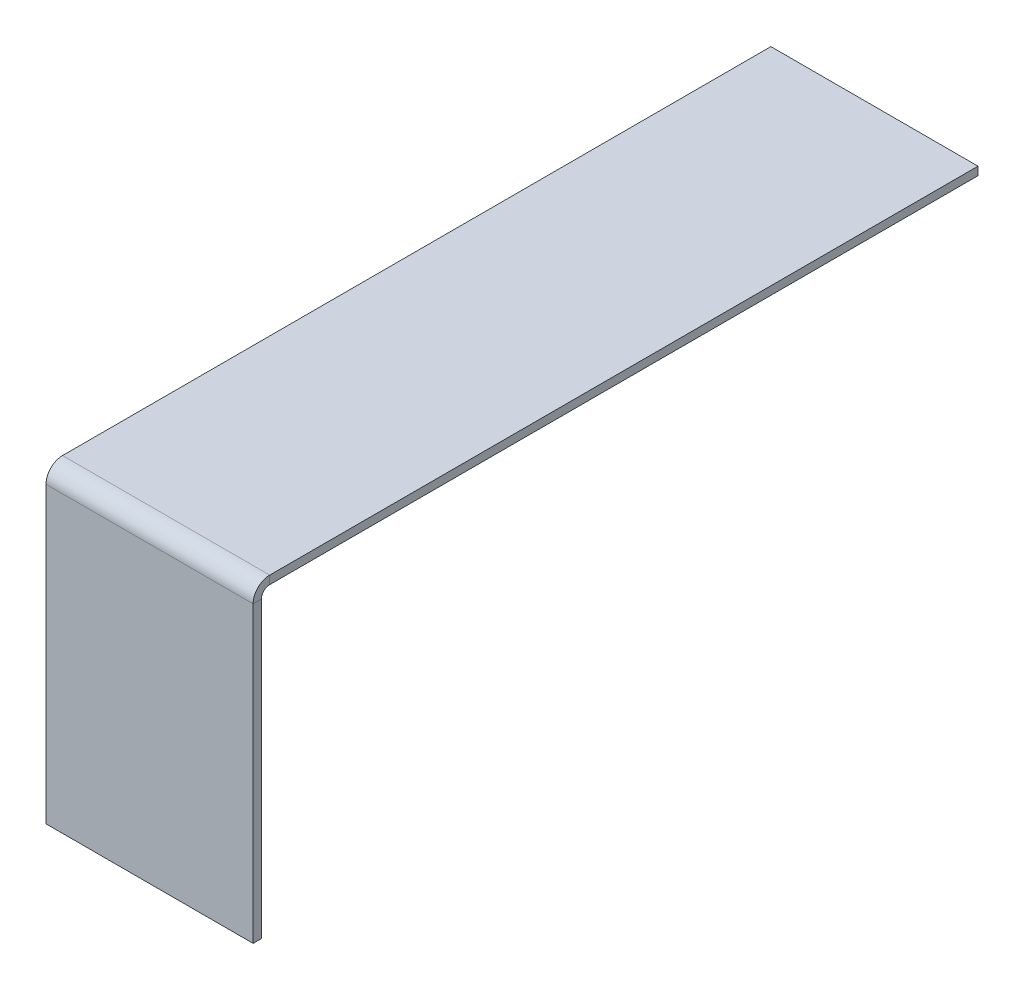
ISO-10303-21;
HEADER;
FILE_DESCRIPTION(('STEP AP214'),'2;1');
FILE_NAME('part.step','',(''),(''),'','','');
FILE_SCHEMA(('AUTOMOTIVE_DESIGN { 1 0 10303 214 1 1 1 1 }'));
ENDSEC;
DATA;
#1=APPLICATION_CONTEXT('core data for automotive mechanical design processes');
#2=APPLICATION_PROTOCOL_DEFINITION('international standard','automotive_design',2000,#1);
#3=PRODUCT_CONTEXT('',#1,'mechanical');
#4=PRODUCT('Part','Part','',(#3));
#5=PRODUCT_RELATED_PRODUCT_CATEGORY('part','',(#4));
#6=PRODUCT_DEFINITION_FORMATION('','',#4);
#7=PRODUCT_DEFINITION_CONTEXT('part definition',#1,'design');
#8=PRODUCT_DEFINITION('design','',#6,#7);
#9=PRODUCT_DEFINITION_SHAPE('','',#8);
#10=(LENGTH_UNIT() NAMED_UNIT(*) SI_UNIT(.MILLI.,.METRE.));
#11=(NAMED_UNIT(*) PLANE_ANGLE_UNIT() SI_UNIT($,.RADIAN.));
#12=(NAMED_UNIT(*) SI_UNIT($,.STERADIAN.) SOLID_ANGLE_UNIT());
#13=UNCERTAINTY_MEASURE_WITH_UNIT(LENGTH_MEASURE(1.E-05),#10,'distance_accuracy_value','');
#14=(GEOMETRIC_REPRESENTATION_CONTEXT(3) GLOBAL_UNCERTAINTY_ASSIGNED_CONTEXT((#13)) GLOBAL_UNIT_ASSIGNED_CONTEXT((#10,
#11,#12)) REPRESENTATION_CONTEXT('',''));
#15=CARTESIAN_POINT('',(0.,0.,0.));
#16=DIRECTION('',(0.,0.,1.));
#17=DIRECTION('',(1.,0.,0.));
#18=AXIS2_PLACEMENT_3D('',#15,#16,#17);
#19=CARTESIAN_POINT('',(-25.,-256.320080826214,-175.));
#20=DIRECTION('',(0.,0.,1.));
#21=DIRECTION('',(0.,-1.,0.));
#22=AXIS2_PLACEMENT_3D('',#19,#20,#21);
#23=PLANE('',#22);
#24=DIRECTION('',(0.,1.,0.));
#25=VECTOR('',#24,1.);
#26=CARTESIAN_POINT('',(-25.,-256.320080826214,-175.));
#27=LINE('',#26,#25);
#28=CARTESIAN_POINT('',(-25.,98.,-175.));
#29=VERTEX_POINT('',#28);
#30=CARTESIAN_POINT('',(-25.,100.,-175.));
#31=VERTEX_POINT('',#30);
#32=EDGE_CURVE('E72',#29,#31,#27,.T.);
#33=ORIENTED_EDGE('',*,*,#32,.T.);
#34=DIRECTION('',(1.,0.,0.));
#35=VECTOR('',#34,1.);
#36=CARTESIAN_POINT('',(-25.,100.,-175.));
#37=LINE('',#36,#35);
#38=CARTESIAN_POINT('',(25.,100.,-175.));
#39=VERTEX_POINT('',#38);
#40=EDGE_CURVE('E137',#31,#39,#37,.T.);
#41=ORIENTED_EDGE('',*,*,#40,.T.);
#42=DIRECTION('',(0.,1.,0.));
#43=VECTOR('',#42,1.);
#44=CARTESIAN_POINT('',(25.,-256.320080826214,-175.));
#45=LINE('',#44,#43);
#46=CARTESIAN_POINT('',(25.,98.,-175.));
#47=VERTEX_POINT('',#46);
#48=EDGE_CURVE('E159',#47,#39,#45,.T.);
#49=ORIENTED_EDGE('',*,*,#48,.F.);
#50=DIRECTION('',(1.,0.,0.));
#51=VECTOR('',#50,1.);
#52=CARTESIAN_POINT('',(-25.,98.,-175.));
#53=LINE('',#52,#51);
#54=EDGE_CURVE('E41',#29,#47,#53,.T.);
#55=ORIENTED_EDGE('',*,*,#54,.F.);
#56=EDGE_LOOP('',(#33,#41,#49,#55));
#57=FACE_BOUND('',#56,.T.);
#58=ADVANCED_FACE('F31',(#57),#23,.F.);
#59=CARTESIAN_POINT('',(-25.,-256.320080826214,-4.));
#60=DIRECTION('',(1.,0.,0.));
#61=DIRECTION('',(0.,-1.,0.));
#62=AXIS2_PLACEMENT_3D('',#59,#60,#61);
#63=PLANE('',#62);
#64=DIRECTION('',(0.,1.,0.));
#65=VECTOR('',#64,1.);
#66=CARTESIAN_POINT('',(-25.,-256.320080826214,-4.));
#67=LINE('',#66,#65);
#68=CARTESIAN_POINT('',(-25.,98.,-4.));
#69=VERTEX_POINT('',#68);
#70=CARTESIAN_POINT('',(-25.,100.,-4.00000000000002));
#71=VERTEX_POINT('',#70);
#72=EDGE_CURVE('E131',#69,#71,#67,.T.);
#73=ORIENTED_EDGE('',*,*,#72,.T.);
#74=DIRECTION('',(0.,0.,-1.));
#75=VECTOR('',#74,1.);
#76=CARTESIAN_POINT('',(-25.,100.,-3.99999999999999));
#77=LINE('',#76,#75);
#78=EDGE_CURVE('E126',#71,#31,#77,.T.);
#79=ORIENTED_EDGE('',*,*,#78,.T.);
#80=ORIENTED_EDGE('',*,*,#32,.F.);
#81=DIRECTION('',(0.,0.,-1.));
#82=VECTOR('',#81,1.);
#83=CARTESIAN_POINT('',(-25.,98.,-3.99999999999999));
#84=LINE('',#83,#82);
#85=EDGE_CURVE('E11',#69,#29,#84,.T.);
#86=ORIENTED_EDGE('',*,*,#85,.F.);
#87=EDGE_LOOP('',(#73,#79,#80,#86));
#88=FACE_BOUND('',#87,.T.);
#89=ADVANCED_FACE('F139',(#88),#63,.F.);
#90=CARTESIAN_POINT('',(-25.,100.,-3.99999999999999));
#91=DIRECTION('',(0.,-1.,0.));
#92=DIRECTION('',(0.,0.,-1.));
#93=AXIS2_PLACEMENT_3D('',#90,#91,#92);
#94=PLANE('',#93);
#95=DIRECTION('',(1.,0.,0.));
#96=VECTOR('',#95,1.);
#97=CARTESIAN_POINT('',(-25.,100.,-3.99999999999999));
#98=LINE('',#97,#96);
#99=CARTESIAN_POINT('',(25.,100.,-3.99999999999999));
#100=VERTEX_POINT('',#99);
#101=EDGE_CURVE('E117',#71,#100,#98,.T.);
#102=ORIENTED_EDGE('',*,*,#101,.T.);
#103=DIRECTION('',(0.,0.,-1.));
#104=VECTOR('',#103,1.);
#105=CARTESIAN_POINT('',(25.,100.,-3.99999999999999));
#106=LINE('',#105,#104);
#107=EDGE_CURVE('E65',#100,#39,#106,.T.);
#108=ORIENTED_EDGE('',*,*,#107,.T.);
#109=ORIENTED_EDGE('',*,*,#40,.F.);
#110=ORIENTED_EDGE('',*,*,#78,.F.);
#111=EDGE_LOOP('',(#102,#108,#109,#110));
#112=FACE_BOUND('',#111,.T.);
#113=ADVANCED_FACE('F136',(#112),#94,.F.);
#114=CARTESIAN_POINT('',(25.,-256.320080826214,-4.));
#115=DIRECTION('',(1.,0.,0.));
#116=DIRECTION('',(0.,-1.,0.));
#117=AXIS2_PLACEMENT_3D('',#114,#115,#116);
#118=PLANE('',#117);
#119=ORIENTED_EDGE('',*,*,#107,.F.);
#120=DIRECTION('',(0.,1.,0.));
#121=VECTOR('',#120,1.);
#122=CARTESIAN_POINT('',(25.,-256.320080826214,-4.));
#123=LINE('',#122,#121);
#124=CARTESIAN_POINT('',(25.,98.,-4.));
#125=VERTEX_POINT('',#124);
#126=EDGE_CURVE('E144',#125,#100,#123,.T.);
#127=ORIENTED_EDGE('',*,*,#126,.F.);
#128=DIRECTION('',(0.,0.,-1.));
#129=VECTOR('',#128,1.);
#130=CARTESIAN_POINT('',(25.,98.,-3.99999999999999));
#131=LINE('',#130,#129);
#132=EDGE_CURVE('E50',#125,#47,#131,.T.);
#133=ORIENTED_EDGE('',*,*,#132,.T.);
#134=ORIENTED_EDGE('',*,*,#48,.T.);
#135=EDGE_LOOP('',(#119,#127,#133,#134));
#136=FACE_BOUND('',#135,.T.);
#137=ADVANCED_FACE('F162',(#136),#118,.T.);
#138=CARTESIAN_POINT('',(-25.,98.,-3.99999999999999));
#139=DIRECTION('',(0.,-1.,0.));
#140=DIRECTION('',(0.,0.,-1.));
#141=AXIS2_PLACEMENT_3D('',#138,#139,#140);
#142=PLANE('',#141);
#143=ORIENTED_EDGE('',*,*,#54,.T.);
#144=ORIENTED_EDGE('',*,*,#132,.F.);
#145=DIRECTION('',(1.,0.,0.));
#146=VECTOR('',#145,1.);
#147=CARTESIAN_POINT('',(-25.,98.,-3.99999999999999));
#148=LINE('',#147,#146);
#149=EDGE_CURVE('E35',#69,#125,#148,.T.);
#150=ORIENTED_EDGE('',*,*,#149,.F.);
#151=ORIENTED_EDGE('',*,*,#85,.T.);
#152=EDGE_LOOP('',(#143,#144,#150,#151));
#153=FACE_BOUND('',#152,.T.);
#154=ADVANCED_FACE('F33',(#153),#142,.T.);
#155=CARTESIAN_POINT('',(-25.,25.,0.));
#156=DIRECTION('',(0.,0.,-1.));
#157=DIRECTION('',(0.,1.,0.));
#158=AXIS2_PLACEMENT_3D('',#155,#156,#157);
#159=PLANE('',#158);
#160=DIRECTION('',(1.,0.,0.));
#161=VECTOR('',#160,1.);
#162=CARTESIAN_POINT('',(-25.,25.,0.));
#163=LINE('',#162,#161);
#164=CARTESIAN_POINT('',(-25.,25.,0.));
#165=VERTEX_POINT('',#164);
#166=CARTESIAN_POINT('',(25.,25.,0.));
#167=VERTEX_POINT('',#166);
#168=EDGE_CURVE('E282',#165,#167,#163,.T.);
#169=ORIENTED_EDGE('',*,*,#168,.T.);
#170=DIRECTION('',(0.,1.,0.));
#171=VECTOR('',#170,1.);
#172=CARTESIAN_POINT('',(25.,25.,0.));
#173=LINE('',#172,#171);
#174=CARTESIAN_POINT('',(25.,96.,0.));
#175=VERTEX_POINT('',#174);
#176=EDGE_CURVE('E284',#167,#175,#173,.T.);
#177=ORIENTED_EDGE('',*,*,#176,.T.);
#178=DIRECTION('',(1.,0.,0.));
#179=VECTOR('',#178,1.);
#180=CARTESIAN_POINT('',(-25.,96.,0.));
#181=LINE('',#180,#179);
#182=CARTESIAN_POINT('',(-25.,96.,0.));
#183=VERTEX_POINT('',#182);
#184=EDGE_CURVE('E287',#183,#175,#181,.T.);
#185=ORIENTED_EDGE('',*,*,#184,.F.);
#186=DIRECTION('',(0.,1.,0.));
#187=VECTOR('',#186,1.);
#188=CARTESIAN_POINT('',(-25.,25.,0.));
#189=LINE('',#188,#187);
#190=EDGE_CURVE('E289',#165,#183,#189,.T.);
#191=ORIENTED_EDGE('',*,*,#190,.F.);
#192=EDGE_LOOP('',(#169,#177,#185,#191));
#193=FACE_BOUND('',#192,.T.);
#194=ADVANCED_FACE('F166',(#193),#159,.F.);
#195=CARTESIAN_POINT('',(25.,25.,-173.677862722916));
#196=DIRECTION('',(1.,0.,0.));
#197=DIRECTION('',(0.,0.,-1.));
#198=AXIS2_PLACEMENT_3D('',#195,#196,#197);
#199=PLANE('',#198);
#200=ORIENTED_EDGE('',*,*,#176,.F.);
#201=DIRECTION('',(0.,0.,1.));
#202=VECTOR('',#201,1.);
#203=CARTESIAN_POINT('',(25.,25.,-173.677862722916));
#204=LINE('',#203,#202);
#205=CARTESIAN_POINT('',(25.,25.,-2.));
#206=VERTEX_POINT('',#205);
#207=EDGE_CURVE('E148',#206,#167,#204,.T.);
#208=ORIENTED_EDGE('',*,*,#207,.F.);
#209=DIRECTION('',(0.,1.,0.));
#210=VECTOR('',#209,1.);
#211=CARTESIAN_POINT('',(25.,25.,-2.));
#212=LINE('',#211,#210);
#213=CARTESIAN_POINT('',(25.,96.,-2.));
#214=VERTEX_POINT('',#213);
#215=EDGE_CURVE('E293',#206,#214,#212,.T.);
#216=ORIENTED_EDGE('',*,*,#215,.T.);
#217=DIRECTION('',(0.,0.,1.));
#218=VECTOR('',#217,1.);
#219=CARTESIAN_POINT('',(25.,96.,-173.677862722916));
#220=LINE('',#219,#218);
#221=EDGE_CURVE('E146',#214,#175,#220,.T.);
#222=ORIENTED_EDGE('',*,*,#221,.T.);
#223=EDGE_LOOP('',(#200,#208,#216,#222));
#224=FACE_BOUND('',#223,.T.);
#225=ADVANCED_FACE('F171',(#224),#199,.T.);
#226=CARTESIAN_POINT('',(-25.,25.,-173.677862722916));
#227=DIRECTION('',(0.,-1.,0.));
#228=DIRECTION('',(0.,0.,-1.));
#229=AXIS2_PLACEMENT_3D('',#226,#227,#228);
#230=PLANE('',#229);
#231=ORIENTED_EDGE('',*,*,#168,.F.);
#232=DIRECTION('',(0.,0.,1.));
#233=VECTOR('',#232,1.);
#234=CARTESIAN_POINT('',(-25.,25.,-173.677862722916));
#235=LINE('',#234,#233);
#236=CARTESIAN_POINT('',(-25.,25.,-2.));
#237=VERTEX_POINT('',#236);
#238=EDGE_CURVE('E153',#237,#165,#235,.T.);
#239=ORIENTED_EDGE('',*,*,#238,.F.);
#240=DIRECTION('',(1.,0.,0.));
#241=VECTOR('',#240,1.);
#242=CARTESIAN_POINT('',(-25.,25.,-2.));
#243=LINE('',#242,#241);
#244=EDGE_CURVE('E88',#237,#206,#243,.T.);
#245=ORIENTED_EDGE('',*,*,#244,.T.);
#246=ORIENTED_EDGE('',*,*,#207,.T.);
#247=EDGE_LOOP('',(#231,#239,#245,#246));
#248=FACE_BOUND('',#247,.T.);
#249=ADVANCED_FACE('F211',(#248),#230,.T.);
#250=CARTESIAN_POINT('',(-25.,25.,-173.677862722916));
#251=DIRECTION('',(1.,0.,0.));
#252=DIRECTION('',(0.,0.,-1.));
#253=AXIS2_PLACEMENT_3D('',#250,#251,#252);
#254=PLANE('',#253);
#255=ORIENTED_EDGE('',*,*,#238,.T.);
#256=ORIENTED_EDGE('',*,*,#190,.T.);
#257=DIRECTION('',(0.,0.,1.));
#258=VECTOR('',#257,1.);
#259=CARTESIAN_POINT('',(-25.,96.,-173.677862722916));
#260=LINE('',#259,#258);
#261=CARTESIAN_POINT('',(-25.,96.,-1.99999999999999));
#262=VERTEX_POINT('',#261);
#263=EDGE_CURVE('E134',#262,#183,#260,.T.);
#264=ORIENTED_EDGE('',*,*,#263,.F.);
#265=DIRECTION('',(0.,1.,0.));
#266=VECTOR('',#265,1.);
#267=CARTESIAN_POINT('',(-25.,25.,-2.));
#268=LINE('',#267,#266);
#269=EDGE_CURVE('E296',#237,#262,#268,.T.);
#270=ORIENTED_EDGE('',*,*,#269,.F.);
#271=EDGE_LOOP('',(#255,#256,#264,#270));
#272=FACE_BOUND('',#271,.T.);
#273=ADVANCED_FACE('F219',(#272),#254,.F.);
#274=CARTESIAN_POINT('',(-25.,25.,-2.));
#275=DIRECTION('',(0.,0.,-1.));
#276=DIRECTION('',(0.,1.,0.));
#277=AXIS2_PLACEMENT_3D('',#274,#275,#276);
#278=PLANE('',#277);
#279=DIRECTION('',(1.,0.,0.));
#280=VECTOR('',#279,1.);
#281=CARTESIAN_POINT('',(-25.,96.,-1.99999999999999));
#282=LINE('',#281,#280);
#283=EDGE_CURVE('E277',#262,#214,#282,.T.);
#284=ORIENTED_EDGE('',*,*,#283,.T.);
#285=ORIENTED_EDGE('',*,*,#215,.F.);
#286=ORIENTED_EDGE('',*,*,#244,.F.);
#287=ORIENTED_EDGE('',*,*,#269,.T.);
#288=EDGE_LOOP('',(#284,#285,#286,#287));
#289=FACE_BOUND('',#288,.T.);
#290=ADVANCED_FACE('F227',(#289),#278,.T.);
#291=CARTESIAN_POINT('',(25.,96.,-3.99999999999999));
#292=DIRECTION('',(1.,0.,0.));
#293=DIRECTION('',(0.,0.,-1.));
#294=AXIS2_PLACEMENT_3D('',#291,#292,#293);
#295=PLANE('',#294);
#296=ORIENTED_EDGE('',*,*,#221,.F.);
#297=CARTESIAN_POINT('',(25.,96.,-3.99999999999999));
#298=DIRECTION('',(1.,0.,0.));
#299=DIRECTION('',(0.,0.,-1.));
#300=AXIS2_PLACEMENT_3D('',#297,#298,#299);
#301=CIRCLE('',#300,2.);
#302=EDGE_CURVE('E80',#214,#125,#301,.F.);
#303=ORIENTED_EDGE('',*,*,#302,.T.);
#304=ORIENTED_EDGE('',*,*,#126,.T.);
#305=CARTESIAN_POINT('',(25.,96.,-3.99999999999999));
#306=DIRECTION('',(1.,0.,0.));
#307=DIRECTION('',(0.,0.,-1.));
#308=AXIS2_PLACEMENT_3D('',#305,#306,#307);
#309=CIRCLE('',#308,4.);
#310=EDGE_CURVE('E123',#175,#100,#309,.F.);
#311=ORIENTED_EDGE('',*,*,#310,.F.);
#312=EDGE_LOOP('',(#296,#303,#304,#311));
#313=FACE_BOUND('',#312,.T.);
#314=ADVANCED_FACE('F237',(#313),#295,.T.);
#315=CARTESIAN_POINT('',(-25.,96.,-3.99999999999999));
#316=DIRECTION('',(-1.,0.,0.));
#317=DIRECTION('',(0.,0.,1.));
#318=AXIS2_PLACEMENT_3D('',#315,#316,#317);
#319=PLANE('',#318);
#320=ORIENTED_EDGE('',*,*,#72,.F.);
#321=CARTESIAN_POINT('',(-25.,96.,-3.99999999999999));
#322=DIRECTION('',(1.,0.,0.));
#323=DIRECTION('',(0.,0.,-1.));
#324=AXIS2_PLACEMENT_3D('',#321,#322,#323);
#325=CIRCLE('',#324,2.);
#326=EDGE_CURVE('E275',#69,#262,#325,.T.);
#327=ORIENTED_EDGE('',*,*,#326,.T.);
#328=ORIENTED_EDGE('',*,*,#263,.T.);
#329=CARTESIAN_POINT('',(-25.,96.,-3.99999999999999));
#330=DIRECTION('',(1.,0.,0.));
#331=DIRECTION('',(0.,0.,-1.));
#332=AXIS2_PLACEMENT_3D('',#329,#330,#331);
#333=CIRCLE('',#332,4.);
#334=EDGE_CURVE('E121',#71,#183,#333,.T.);
#335=ORIENTED_EDGE('',*,*,#334,.F.);
#336=EDGE_LOOP('',(#320,#327,#328,#335));
#337=FACE_BOUND('',#336,.T.);
#338=ADVANCED_FACE('F129',(#337),#319,.T.);
#339=CARTESIAN_POINT('',(-276.582035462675,96.,-3.99999999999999));
#340=DIRECTION('',(1.,0.,0.));
#341=DIRECTION('',(0.,0.,-1.));
#342=AXIS2_PLACEMENT_3D('',#339,#340,#341);
#343=CYLINDRICAL_SURFACE('',#342,4.);
#344=ORIENTED_EDGE('',*,*,#334,.T.);
#345=ORIENTED_EDGE('',*,*,#184,.T.);
#346=ORIENTED_EDGE('',*,*,#310,.T.);
#347=ORIENTED_EDGE('',*,*,#101,.F.);
#348=EDGE_LOOP('',(#344,#345,#346,#347));
#349=FACE_BOUND('',#348,.T.);
#350=ADVANCED_FACE('F119',(#349),#343,.T.);
#351=CARTESIAN_POINT('',(-276.582035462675,96.,-3.99999999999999));
#352=DIRECTION('',(1.,0.,0.));
#353=DIRECTION('',(0.,0.,-1.));
#354=AXIS2_PLACEMENT_3D('',#351,#352,#353);
#355=CYLINDRICAL_SURFACE('',#354,2.);
#356=ORIENTED_EDGE('',*,*,#326,.F.);
#357=ORIENTED_EDGE('',*,*,#149,.T.);
#358=ORIENTED_EDGE('',*,*,#302,.F.);
#359=ORIENTED_EDGE('',*,*,#283,.F.);
#360=EDGE_LOOP('',(#356,#357,#358,#359));
#361=FACE_BOUND('',#360,.T.);
#362=ADVANCED_FACE('F263',(#361),#355,.F.);
#363=CLOSED_SHELL('',(#58,#89,#113,#137,#154,#194,#225,#249,#273,#290,#314,#338,#350,#362));
#364=MANIFOLD_SOLID_BREP('B2',#363);
#365=ADVANCED_BREP_SHAPE_REPRESENTATION('',(#18,#364),#14);
#366=SHAPE_DEFINITION_REPRESENTATION(#9,#365);
ENDSEC;
END-ISO-10303-21;
